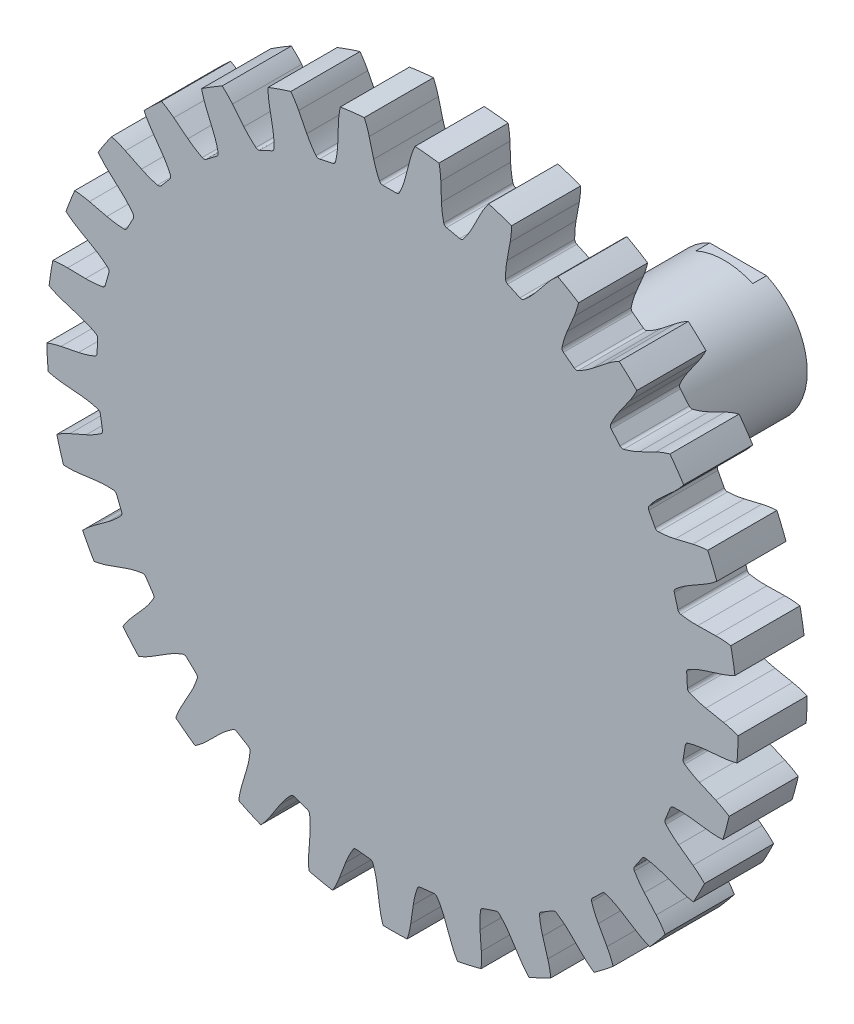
from build123d import *

# Parameters (mm, degrees)
SKETCH1_R          = 63.5
EXTRUDE1_DEPTH     = 12.7
SKETCH3_R          = 12.7
EXTRUDE2_DEPTH     = 50.8
CUT_EXTRUDE2_DEPTH = 122.121019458
CIRPATTERN3_COUNT  = 29
CUT_EXTRUDE3_START = -2.54
CUT_EXTRUDE3_DEPTH = 2.54


with BuildPart() as part:
    # Sketch1 → Extrude1 (new body)
    with BuildSketch(Plane.XY):
        Circle(SKETCH1_R)
    extrude(amount=EXTRUDE1_DEPTH)

    # Sketch3 → Extrude2 (add)
    with BuildSketch(Plane(origin=(0, 0, 0), x_dir=(-1, 0, 0), z_dir=(0, 0, -1))):
        with Locations(Location((0, 0, 0), (0, 0, 180))):
            Circle(SKETCH3_R)
    extrude(amount=EXTRUDE2_DEPTH)

    # Sketch4 → Cut-Extrude2 (cut, through all)
    with BuildSketch(Plane(origin=(-0.53626367, -17.354241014, 12.7), x_dir=(1, 0, 0), z_dir=(0, 0, 1))):
        with BuildLine():
            Line((-129.068430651, 352.093803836), (-4.656553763, 80.717984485))
            ThreePointArc((-4.656553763, 80.717984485), (-4.128869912, 79.418245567), (-3.717983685, 78.076998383))
            Line((-3.717983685, 78.076998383), (-2.894365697, 74.892303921))
            ThreePointArc((-2.894365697, 74.892303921), (-2.42922611, 73.400796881), (-1.819728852, 71.96223469))
            ThreePointArc((-1.819728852, 71.96223469), (-1.574529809, 71.688347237), (-1.221257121, 71.586684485))
            Line((-1.221257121, 71.586684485), (1.25861219, 71.586684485))
            ThreePointArc((1.25861219, 71.586684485), (1.611884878, 71.688347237), (1.85708392, 71.96223469))
            ThreePointArc((1.85708392, 71.96223469), (2.466581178, 73.400796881), (2.931720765, 74.892303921))
            Line((2.931720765, 74.892303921), (3.755338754, 78.076998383))
            ThreePointArc((3.755338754, 78.076998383), (4.16622498, 79.418245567), (4.693908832, 80.717984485))
            Line((4.693908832, 80.717984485), (129.10578572, 352.093803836))
            Line((129.10578572, 352.093803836), (129.10578572, 949.163817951))
            Line((129.10578572, 949.163817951), (-129.068430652, 949.163817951))
            Line((-129.068430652, 949.163817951), (-129.068430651, 352.093803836))
        make_face()
    cut_extrude2 = extrude(amount=-CUT_EXTRUDE2_DEPTH, mode=Mode.SUBTRACT)

    # CirPattern3: Cut-Extrude2 ×29 about axis
    cirpattern3_axis = Axis((0, 0, 0), (0, 0, 1))
    for i in range(1, CIRPATTERN3_COUNT):
        add(cut_extrude2.rotate(cirpattern3_axis, i * 360 / CIRPATTERN3_COUNT), mode=Mode.SUBTRACT)

    # Sketch5 → Cut-Extrude3 (cut)
    with BuildSketch(Plane(origin=(0, 0, -50.8), x_dir=(-1, 0, 0), z_dir=(0, 0, -1)).offset(CUT_EXTRUDE3_START)):
        with BuildLine():
            Line((-5.216887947, 11.579036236), (5.216887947, 11.579036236))
            ThreePointArc((5.216887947, 11.579036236), (0, 12.7), (-5.216887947, 11.579036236))
        make_face()
    extrude(amount=CUT_EXTRUDE3_DEPTH, mode=Mode.SUBTRACT)


solid = part.part
